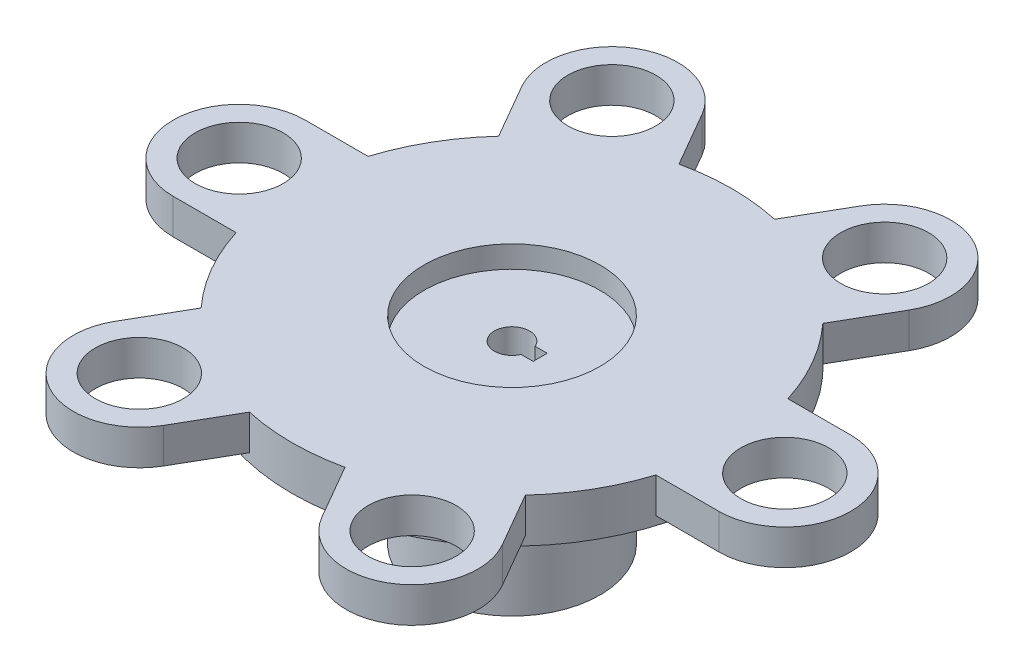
ISO-10303-21;
HEADER;
FILE_DESCRIPTION(('STEP AP214'),'2;1');
FILE_NAME('part.step','',(''),(''),'','','');
FILE_SCHEMA(('AUTOMOTIVE_DESIGN { 1 0 10303 214 1 1 1 1 }'));
ENDSEC;
DATA;
#1=APPLICATION_CONTEXT('core data for automotive mechanical design processes');
#2=APPLICATION_PROTOCOL_DEFINITION('international standard','automotive_design',2000,#1);
#3=PRODUCT_CONTEXT('',#1,'mechanical');
#4=PRODUCT('Part','Part','',(#3));
#5=PRODUCT_RELATED_PRODUCT_CATEGORY('part','',(#4));
#6=PRODUCT_DEFINITION_FORMATION('','',#4);
#7=PRODUCT_DEFINITION_CONTEXT('part definition',#1,'design');
#8=PRODUCT_DEFINITION('design','',#6,#7);
#9=PRODUCT_DEFINITION_SHAPE('','',#8);
#10=(LENGTH_UNIT() NAMED_UNIT(*) SI_UNIT(.MILLI.,.METRE.));
#11=(NAMED_UNIT(*) PLANE_ANGLE_UNIT() SI_UNIT($,.RADIAN.));
#12=(NAMED_UNIT(*) SI_UNIT($,.STERADIAN.) SOLID_ANGLE_UNIT());
#13=UNCERTAINTY_MEASURE_WITH_UNIT(LENGTH_MEASURE(1.E-05),#10,'distance_accuracy_value','');
#14=(GEOMETRIC_REPRESENTATION_CONTEXT(3) GLOBAL_UNCERTAINTY_ASSIGNED_CONTEXT((#13)) GLOBAL_UNIT_ASSIGNED_CONTEXT((#10,
#11,#12)) REPRESENTATION_CONTEXT('',''));
#15=CARTESIAN_POINT('',(0.,0.,0.));
#16=DIRECTION('',(0.,0.,1.));
#17=DIRECTION('',(1.,0.,0.));
#18=AXIS2_PLACEMENT_3D('',#15,#16,#17);
#19=CARTESIAN_POINT('',(0.,10.,0.));
#20=DIRECTION('',(0.,-1.,0.));
#21=DIRECTION('',(0.,0.,-1.));
#22=AXIS2_PLACEMENT_3D('',#19,#20,#21);
#23=CYLINDRICAL_SURFACE('',#22,10.);
#24=CARTESIAN_POINT('',(0.,-10.,0.));
#25=DIRECTION('',(0.,1.,0.));
#26=DIRECTION('',(0.,0.,1.));
#27=AXIS2_PLACEMENT_3D('',#24,#25,#26);
#28=CIRCLE('',#27,10.);
#29=CARTESIAN_POINT('',(0.,-10.,10.));
#30=VERTEX_POINT('',#29);
#31=EDGE_CURVE('E389',#30,#30,#28,.T.);
#32=ORIENTED_EDGE('',*,*,#31,.T.);
#33=EDGE_LOOP('',(#32));
#34=FACE_BOUND('',#33,.T.);
#35=CARTESIAN_POINT('',(0.,7.5,0.));
#36=DIRECTION('',(0.,1.,0.));
#37=DIRECTION('',(0.,0.,1.));
#38=AXIS2_PLACEMENT_3D('',#35,#36,#37);
#39=CIRCLE('',#38,10.);
#40=CARTESIAN_POINT('',(0.,7.5,10.));
#41=VERTEX_POINT('',#40);
#42=EDGE_CURVE('E401',#41,#41,#39,.T.);
#43=ORIENTED_EDGE('',*,*,#42,.F.);
#44=EDGE_LOOP('',(#43));
#45=FACE_BOUND('',#44,.T.);
#46=ADVANCED_FACE('F35',(#34,#45),#23,.T.);
#47=CARTESIAN_POINT('',(0.,10.,0.));
#48=DIRECTION('',(0.,1.,0.));
#49=DIRECTION('',(0.,0.,1.));
#50=AXIS2_PLACEMENT_3D('',#47,#48,#49);
#51=PLANE('',#50);
#52=DIRECTION('',(1.,0.,0.));
#53=VECTOR('',#52,1.);
#54=CARTESIAN_POINT('',(1.59788848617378,10.,0.8));
#55=LINE('',#54,#53);
#56=CARTESIAN_POINT('',(1.83303027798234,10.,0.8));
#57=VERTEX_POINT('',#56);
#58=CARTESIAN_POINT('',(3.2,10.,0.8));
#59=VERTEX_POINT('',#58);
#60=EDGE_CURVE('E372',#57,#59,#55,.T.);
#61=ORIENTED_EDGE('',*,*,#60,.F.);
#62=CARTESIAN_POINT('',(0.,10.,0.));
#63=DIRECTION('',(0.,1.,0.));
#64=DIRECTION('',(0.,0.,1.));
#65=AXIS2_PLACEMENT_3D('',#62,#63,#64);
#66=CIRCLE('',#65,2.);
#67=CARTESIAN_POINT('',(1.83303027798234,10.,-0.8));
#68=VERTEX_POINT('',#67);
#69=EDGE_CURVE('E386',#68,#57,#66,.T.);
#70=ORIENTED_EDGE('',*,*,#69,.F.);
#71=DIRECTION('',(-1.,0.,0.));
#72=VECTOR('',#71,1.);
#73=CARTESIAN_POINT('',(1.59788848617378,10.,-0.8));
#74=LINE('',#73,#72);
#75=CARTESIAN_POINT('',(3.2,10.,-0.8));
#76=VERTEX_POINT('',#75);
#77=EDGE_CURVE('E370',#76,#68,#74,.T.);
#78=ORIENTED_EDGE('',*,*,#77,.F.);
#79=DIRECTION('',(0.,0.,-1.));
#80=VECTOR('',#79,1.);
#81=CARTESIAN_POINT('',(3.2,10.,-0.8));
#82=LINE('',#81,#80);
#83=EDGE_CURVE('E367',#59,#76,#82,.T.);
#84=ORIENTED_EDGE('',*,*,#83,.F.);
#85=EDGE_LOOP('',(#61,#70,#78,#84));
#86=FACE_BOUND('',#85,.T.);
#87=CARTESIAN_POINT('',(0.,10.,0.));
#88=DIRECTION('',(0.,1.,0.));
#89=DIRECTION('',(0.,0.,1.));
#90=AXIS2_PLACEMENT_3D('',#87,#88,#89);
#91=CIRCLE('',#90,10.);
#92=CARTESIAN_POINT('',(0.,10.,10.));
#93=VERTEX_POINT('',#92);
#94=EDGE_CURVE('E360',#93,#93,#91,.F.);
#95=ORIENTED_EDGE('',*,*,#94,.F.);
#96=EDGE_LOOP('',(#95));
#97=FACE_BOUND('',#96,.T.);
#98=ADVANCED_FACE('F481',(#86,#97),#51,.T.);
#99=CARTESIAN_POINT('',(0.,-10.,0.));
#100=DIRECTION('',(0.,1.,0.));
#101=DIRECTION('',(0.,0.,1.));
#102=AXIS2_PLACEMENT_3D('',#99,#100,#101);
#103=PLANE('',#102);
#104=ORIENTED_EDGE('',*,*,#31,.F.);
#105=EDGE_LOOP('',(#104));
#106=FACE_BOUND('',#105,.T.);
#107=CARTESIAN_POINT('',(0.,-10.,0.));
#108=DIRECTION('',(0.,1.,0.));
#109=DIRECTION('',(0.,0.,1.));
#110=AXIS2_PLACEMENT_3D('',#107,#108,#109);
#111=CIRCLE('',#110,2.);
#112=CARTESIAN_POINT('',(1.83303027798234,-10.,-0.8));
#113=VERTEX_POINT('',#112);
#114=CARTESIAN_POINT('',(1.83303027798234,-10.,0.8));
#115=VERTEX_POINT('',#114);
#116=EDGE_CURVE('E385',#113,#115,#111,.T.);
#117=ORIENTED_EDGE('',*,*,#116,.T.);
#118=DIRECTION('',(1.,0.,0.));
#119=VECTOR('',#118,1.);
#120=CARTESIAN_POINT('',(0.,-10.,0.8));
#121=LINE('',#120,#119);
#122=CARTESIAN_POINT('',(3.2,-10.,0.8));
#123=VERTEX_POINT('',#122);
#124=EDGE_CURVE('E382',#115,#123,#121,.T.);
#125=ORIENTED_EDGE('',*,*,#124,.T.);
#126=DIRECTION('',(0.,0.,-1.));
#127=VECTOR('',#126,1.);
#128=CARTESIAN_POINT('',(3.2,-10.,0.));
#129=LINE('',#128,#127);
#130=CARTESIAN_POINT('',(3.2,-10.,-0.8));
#131=VERTEX_POINT('',#130);
#132=EDGE_CURVE('E398',#123,#131,#129,.T.);
#133=ORIENTED_EDGE('',*,*,#132,.T.);
#134=DIRECTION('',(-1.,0.,0.));
#135=VECTOR('',#134,1.);
#136=CARTESIAN_POINT('',(0.,-10.,-0.8));
#137=LINE('',#136,#135);
#138=EDGE_CURVE('E378',#131,#113,#137,.T.);
#139=ORIENTED_EDGE('',*,*,#138,.T.);
#140=EDGE_LOOP('',(#117,#125,#133,#139));
#141=FACE_BOUND('',#140,.T.);
#142=ADVANCED_FACE('F488',(#106,#141),#103,.F.);
#143=CARTESIAN_POINT('',(0.,10.,0.));
#144=DIRECTION('',(0.,-1.,0.));
#145=DIRECTION('',(0.,0.,-1.));
#146=AXIS2_PLACEMENT_3D('',#143,#144,#145);
#147=CYLINDRICAL_SURFACE('',#146,2.);
#148=DIRECTION('',(0.,-1.,0.));
#149=VECTOR('',#148,1.);
#150=CARTESIAN_POINT('',(1.83303027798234,10.,0.8));
#151=LINE('',#150,#149);
#152=EDGE_CURVE('E396',#115,#57,#151,.F.);
#153=ORIENTED_EDGE('',*,*,#152,.F.);
#154=ORIENTED_EDGE('',*,*,#116,.F.);
#155=DIRECTION('',(0.,-1.,0.));
#156=VECTOR('',#155,1.);
#157=CARTESIAN_POINT('',(1.83303027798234,10.,-0.8));
#158=LINE('',#157,#156);
#159=EDGE_CURVE('E394',#68,#113,#158,.T.);
#160=ORIENTED_EDGE('',*,*,#159,.F.);
#161=ORIENTED_EDGE('',*,*,#69,.T.);
#162=EDGE_LOOP('',(#153,#154,#160,#161));
#163=FACE_BOUND('',#162,.T.);
#164=ADVANCED_FACE('F524',(#163),#147,.F.);
#165=CARTESIAN_POINT('',(3.2,-20.,-0.8));
#166=DIRECTION('',(1.,0.,0.));
#167=DIRECTION('',(0.,0.,-1.));
#168=AXIS2_PLACEMENT_3D('',#165,#166,#167);
#169=PLANE('',#168);
#170=DIRECTION('',(0.,1.,0.));
#171=VECTOR('',#170,1.);
#172=CARTESIAN_POINT('',(3.2,-20.,0.8));
#173=LINE('',#172,#171);
#174=EDGE_CURVE('E376',#123,#59,#173,.T.);
#175=ORIENTED_EDGE('',*,*,#174,.T.);
#176=ORIENTED_EDGE('',*,*,#83,.T.);
#177=DIRECTION('',(0.,1.,0.));
#178=VECTOR('',#177,1.);
#179=CARTESIAN_POINT('',(3.2,-20.,-0.8));
#180=LINE('',#179,#178);
#181=EDGE_CURVE('E375',#131,#76,#180,.T.);
#182=ORIENTED_EDGE('',*,*,#181,.F.);
#183=ORIENTED_EDGE('',*,*,#132,.F.);
#184=EDGE_LOOP('',(#175,#176,#182,#183));
#185=FACE_BOUND('',#184,.T.);
#186=ADVANCED_FACE('F518',(#185),#169,.F.);
#187=CARTESIAN_POINT('',(1.59788848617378,-20.,0.8));
#188=DIRECTION('',(0.,0.,1.));
#189=DIRECTION('',(1.,0.,0.));
#190=AXIS2_PLACEMENT_3D('',#187,#188,#189);
#191=PLANE('',#190);
#192=ORIENTED_EDGE('',*,*,#152,.T.);
#193=ORIENTED_EDGE('',*,*,#60,.T.);
#194=ORIENTED_EDGE('',*,*,#174,.F.);
#195=ORIENTED_EDGE('',*,*,#124,.F.);
#196=EDGE_LOOP('',(#192,#193,#194,#195));
#197=FACE_BOUND('',#196,.T.);
#198=ADVANCED_FACE('F515',(#197),#191,.F.);
#199=CARTESIAN_POINT('',(1.59788848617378,-20.,-0.8));
#200=DIRECTION('',(0.,0.,-1.));
#201=DIRECTION('',(-1.,0.,0.));
#202=AXIS2_PLACEMENT_3D('',#199,#200,#201);
#203=PLANE('',#202);
#204=ORIENTED_EDGE('',*,*,#181,.T.);
#205=ORIENTED_EDGE('',*,*,#77,.T.);
#206=ORIENTED_EDGE('',*,*,#159,.T.);
#207=ORIENTED_EDGE('',*,*,#138,.F.);
#208=EDGE_LOOP('',(#204,#205,#206,#207));
#209=FACE_BOUND('',#208,.T.);
#210=ADVANCED_FACE('F509',(#209),#203,.F.);
#211=CARTESIAN_POINT('',(0.,12.5,0.));
#212=DIRECTION('',(0.,1.,0.));
#213=DIRECTION('',(0.,0.,1.));
#214=AXIS2_PLACEMENT_3D('',#211,#212,#213);
#215=PLANE('',#214);
#216=CARTESIAN_POINT('',(31.,12.5,2.46330733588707E-13));
#217=DIRECTION('',(0.,1.,0.));
#218=DIRECTION('',(0.,0.,1.));
#219=AXIS2_PLACEMENT_3D('',#216,#217,#218);
#220=CIRCLE('',#219,5.);
#221=CARTESIAN_POINT('',(31.,12.5,5.00000000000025));
#222=VERTEX_POINT('',#221);
#223=EDGE_CURVE('E735',#222,#222,#220,.T.);
#224=ORIENTED_EDGE('',*,*,#223,.F.);
#225=EDGE_LOOP('',(#224));
#226=FACE_BOUND('',#225,.T.);
#227=CARTESIAN_POINT('',(15.5000000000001,12.5,-26.8467875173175));
#228=DIRECTION('',(0.,1.,0.));
#229=DIRECTION('',(0.,0.,1.));
#230=AXIS2_PLACEMENT_3D('',#227,#228,#229);
#231=CIRCLE('',#230,5.);
#232=CARTESIAN_POINT('',(15.5000000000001,12.5,-21.8467875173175));
#233=VERTEX_POINT('',#232);
#234=EDGE_CURVE('E734',#233,#233,#231,.T.);
#235=ORIENTED_EDGE('',*,*,#234,.F.);
#236=EDGE_LOOP('',(#235));
#237=FACE_BOUND('',#236,.T.);
#238=CARTESIAN_POINT('',(-15.4999999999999,12.5,-26.8467875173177));
#239=DIRECTION('',(0.,1.,0.));
#240=DIRECTION('',(0.,0.,1.));
#241=AXIS2_PLACEMENT_3D('',#238,#239,#240);
#242=CIRCLE('',#241,5.);
#243=CARTESIAN_POINT('',(-15.4999999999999,12.5,-21.8467875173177));
#244=VERTEX_POINT('',#243);
#245=EDGE_CURVE('E729',#244,#244,#242,.T.);
#246=ORIENTED_EDGE('',*,*,#245,.F.);
#247=EDGE_LOOP('',(#246));
#248=FACE_BOUND('',#247,.T.);
#249=CARTESIAN_POINT('',(-31.,12.5,0.));
#250=DIRECTION('',(0.,1.,0.));
#251=DIRECTION('',(0.,0.,1.));
#252=AXIS2_PLACEMENT_3D('',#249,#250,#251);
#253=CIRCLE('',#252,5.);
#254=CARTESIAN_POINT('',(-31.,12.5,4.99999999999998));
#255=VERTEX_POINT('',#254);
#256=EDGE_CURVE('E725',#255,#255,#253,.T.);
#257=ORIENTED_EDGE('',*,*,#256,.F.);
#258=EDGE_LOOP('',(#257));
#259=FACE_BOUND('',#258,.T.);
#260=CARTESIAN_POINT('',(-15.5,12.5,26.8467875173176));
#261=DIRECTION('',(0.,1.,0.));
#262=DIRECTION('',(0.,0.,1.));
#263=AXIS2_PLACEMENT_3D('',#260,#261,#262);
#264=CIRCLE('',#263,5.00000000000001);
#265=CARTESIAN_POINT('',(-15.5,12.5,31.8467875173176));
#266=VERTEX_POINT('',#265);
#267=EDGE_CURVE('E665',#266,#266,#264,.T.);
#268=ORIENTED_EDGE('',*,*,#267,.F.);
#269=EDGE_LOOP('',(#268));
#270=FACE_BOUND('',#269,.T.);
#271=CARTESIAN_POINT('',(15.4999999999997,12.5,26.8467875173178));
#272=DIRECTION('',(0.,1.,0.));
#273=DIRECTION('',(0.,0.,1.));
#274=AXIS2_PLACEMENT_3D('',#271,#272,#273);
#275=CIRCLE('',#274,5.0000000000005);
#276=CARTESIAN_POINT('',(15.4999999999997,12.5,31.8467875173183));
#277=VERTEX_POINT('',#276);
#278=EDGE_CURVE('E247',#277,#277,#275,.T.);
#279=ORIENTED_EDGE('',*,*,#278,.F.);
#280=EDGE_LOOP('',(#279));
#281=FACE_BOUND('',#280,.T.);
#282=CARTESIAN_POINT('',(0.,12.5,0.));
#283=DIRECTION('',(0.,1.,0.));
#284=DIRECTION('',(0.,0.,1.));
#285=AXIS2_PLACEMENT_3D('',#282,#283,#284);
#286=CIRCLE('',#285,24.999999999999);
#287=CARTESIAN_POINT('',(23.8484800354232,12.5,-7.49999999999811));
#288=VERTEX_POINT('',#287);
#289=CARTESIAN_POINT('',(18.4194305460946,12.5,-16.903389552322));
#290=VERTEX_POINT('',#289);
#291=EDGE_CURVE('E357',#288,#290,#286,.T.);
#292=ORIENTED_EDGE('',*,*,#291,.T.);
#293=DIRECTION('',(0.499999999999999,0.,-0.866025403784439));
#294=VECTOR('',#293,1.);
#295=CARTESIAN_POINT('',(21.9951905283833,12.5,-23.0967875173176));
#296=LINE('',#295,#294);
#297=CARTESIAN_POINT('',(21.9951905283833,12.5,-23.0967875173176));
#298=VERTEX_POINT('',#297);
#299=EDGE_CURVE('E243',#290,#298,#296,.T.);
#300=ORIENTED_EDGE('',*,*,#299,.T.);
#301=CARTESIAN_POINT('',(15.5000000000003,12.5,-26.8467875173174));
#302=DIRECTION('',(0.,1.,0.));
#303=DIRECTION('',(0.,0.,1.));
#304=AXIS2_PLACEMENT_3D('',#301,#302,#303);
#305=CIRCLE('',#304,7.49999999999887);
#306=CARTESIAN_POINT('',(9.00480947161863,12.5,-30.5967875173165));
#307=VERTEX_POINT('',#306);
#308=EDGE_CURVE('E251',#298,#307,#305,.T.);
#309=ORIENTED_EDGE('',*,*,#308,.T.);
#310=DIRECTION('',(-0.499999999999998,0.,0.86602540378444));
#311=VECTOR('',#310,1.);
#312=CARTESIAN_POINT('',(9.00480947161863,12.5,-30.5967875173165));
#313=LINE('',#312,#311);
#314=CARTESIAN_POINT('',(5.4290494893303,12.5,-24.4033895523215));
#315=VERTEX_POINT('',#314);
#316=EDGE_CURVE('E51',#307,#315,#313,.T.);
#317=ORIENTED_EDGE('',*,*,#316,.T.);
#318=CARTESIAN_POINT('',(-5.42904948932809,12.5,-24.403389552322));
#319=VERTEX_POINT('',#318);
#320=EDGE_CURVE('E361',#315,#319,#286,.T.);
#321=ORIENTED_EDGE('',*,*,#320,.T.);
#322=DIRECTION('',(-0.500000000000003,0.,-0.866025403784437));
#323=VECTOR('',#322,1.);
#324=CARTESIAN_POINT('',(-9.00480947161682,12.5,-30.5967875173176));
#325=LINE('',#324,#323);
#326=CARTESIAN_POINT('',(-9.00480947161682,12.5,-30.5967875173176));
#327=VERTEX_POINT('',#326);
#328=EDGE_CURVE('E260',#319,#327,#325,.T.);
#329=ORIENTED_EDGE('',*,*,#328,.T.);
#330=CARTESIAN_POINT('',(-15.4999999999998,12.5,-26.8467875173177));
#331=DIRECTION('',(0.,1.,0.));
#332=DIRECTION('',(0.,0.,1.));
#333=AXIS2_PLACEMENT_3D('',#330,#331,#332);
#334=CIRCLE('',#333,7.49999999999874);
#335=CARTESIAN_POINT('',(-21.995190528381,12.5,-23.0967875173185));
#336=VERTEX_POINT('',#335);
#337=EDGE_CURVE('E254',#327,#336,#334,.T.);
#338=ORIENTED_EDGE('',*,*,#337,.T.);
#339=DIRECTION('',(0.500000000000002,0.,0.866025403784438));
#340=VECTOR('',#339,1.);
#341=CARTESIAN_POINT('',(-21.995190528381,12.5,-23.0967875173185));
#342=LINE('',#341,#340);
#343=CARTESIAN_POINT('',(-18.4194305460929,12.5,-16.9033895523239));
#344=VERTEX_POINT('',#343);
#345=EDGE_CURVE('E58',#336,#344,#342,.T.);
#346=ORIENTED_EDGE('',*,*,#345,.T.);
#347=CARTESIAN_POINT('',(-23.8484800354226,12.5,-7.49999999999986));
#348=VERTEX_POINT('',#347);
#349=EDGE_CURVE('E684',#344,#348,#286,.T.);
#350=ORIENTED_EDGE('',*,*,#349,.T.);
#351=DIRECTION('',(-1.,0.,0.));
#352=VECTOR('',#351,1.);
#353=CARTESIAN_POINT('',(-31.0000000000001,12.5,-7.49999999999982));
#354=LINE('',#353,#352);
#355=CARTESIAN_POINT('',(-31.0000000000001,12.5,-7.49999999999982));
#356=VERTEX_POINT('',#355);
#357=EDGE_CURVE('E278',#348,#356,#354,.T.);
#358=ORIENTED_EDGE('',*,*,#357,.T.);
#359=CARTESIAN_POINT('',(-31.,12.5,-2.16471843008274E-13));
#360=DIRECTION('',(0.,1.,0.));
#361=DIRECTION('',(0.,0.,1.));
#362=AXIS2_PLACEMENT_3D('',#359,#360,#361);
#363=CIRCLE('',#362,7.49999999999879);
#364=CARTESIAN_POINT('',(-30.9999999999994,12.5,7.49999999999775));
#365=VERTEX_POINT('',#364);
#366=EDGE_CURVE('E272',#356,#365,#363,.T.);
#367=ORIENTED_EDGE('',*,*,#366,.T.);
#368=DIRECTION('',(1.,0.,0.));
#369=VECTOR('',#368,1.);
#370=CARTESIAN_POINT('',(-30.9999999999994,12.5,7.49999999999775));
#371=LINE('',#370,#369);
#372=CARTESIAN_POINT('',(-23.8484800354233,12.5,7.49999999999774));
#373=VERTEX_POINT('',#372);
#374=EDGE_CURVE('E286',#365,#373,#371,.T.);
#375=ORIENTED_EDGE('',*,*,#374,.T.);
#376=CARTESIAN_POINT('',(-18.4194305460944,12.5,16.9033895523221));
#377=VERTEX_POINT('',#376);
#378=EDGE_CURVE('E681',#373,#377,#286,.T.);
#379=ORIENTED_EDGE('',*,*,#378,.T.);
#380=DIRECTION('',(-0.499999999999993,0.,0.866025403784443));
#381=VECTOR('',#380,1.);
#382=CARTESIAN_POINT('',(-21.9951905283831,12.5,23.0967875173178));
#383=LINE('',#382,#381);
#384=CARTESIAN_POINT('',(-21.9951905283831,12.5,23.0967875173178));
#385=VERTEX_POINT('',#384);
#386=EDGE_CURVE('E298',#377,#385,#383,.T.);
#387=ORIENTED_EDGE('',*,*,#386,.T.);
#388=CARTESIAN_POINT('',(-15.5000000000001,12.5,26.8467875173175));
#389=DIRECTION('',(0.,1.,0.));
#390=DIRECTION('',(0.,0.,1.));
#391=AXIS2_PLACEMENT_3D('',#388,#389,#390);
#392=CIRCLE('',#391,7.49999999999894);
#393=CARTESIAN_POINT('',(-9.00480947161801,12.5,30.5967875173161));
#394=VERTEX_POINT('',#393);
#395=EDGE_CURVE('E292',#385,#394,#392,.T.);
#396=ORIENTED_EDGE('',*,*,#395,.T.);
#397=DIRECTION('',(0.499999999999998,0.,-0.866025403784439));
#398=VECTOR('',#397,1.);
#399=CARTESIAN_POINT('',(-9.00480947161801,12.5,30.5967875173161));
#400=LINE('',#399,#398);
#401=CARTESIAN_POINT('',(-5.42904948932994,12.5,24.4033895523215));
#402=VERTEX_POINT('',#401);
#403=EDGE_CURVE('E306',#394,#402,#400,.T.);
#404=ORIENTED_EDGE('',*,*,#403,.T.);
#405=CARTESIAN_POINT('',(5.42904948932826,12.5,24.4033895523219));
#406=VERTEX_POINT('',#405);
#407=EDGE_CURVE('E677',#402,#406,#286,.T.);
#408=ORIENTED_EDGE('',*,*,#407,.T.);
#409=DIRECTION('',(0.500000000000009,0.,0.866025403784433));
#410=VECTOR('',#409,1.);
#411=CARTESIAN_POINT('',(9.00480947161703,12.5,30.5967875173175));
#412=LINE('',#411,#410);
#413=CARTESIAN_POINT('',(9.00480947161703,12.5,30.5967875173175));
#414=VERTEX_POINT('',#413);
#415=EDGE_CURVE('E318',#406,#414,#412,.T.);
#416=ORIENTED_EDGE('',*,*,#415,.T.);
#417=CARTESIAN_POINT('',(15.5,12.5,26.8467875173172));
#418=DIRECTION('',(0.,1.,0.));
#419=DIRECTION('',(0.,0.,1.));
#420=AXIS2_PLACEMENT_3D('',#417,#418,#419);
#421=CIRCLE('',#420,7.499999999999);
#422=CARTESIAN_POINT('',(21.9951905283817,12.5,23.0967875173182));
#423=VERTEX_POINT('',#422);
#424=EDGE_CURVE('E312',#414,#423,#421,.T.);
#425=ORIENTED_EDGE('',*,*,#424,.T.);
#426=DIRECTION('',(-0.500000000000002,0.,-0.866025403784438));
#427=VECTOR('',#426,1.);
#428=CARTESIAN_POINT('',(21.9951905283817,12.5,23.0967875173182));
#429=LINE('',#428,#427);
#430=CARTESIAN_POINT('',(18.4194305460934,12.5,16.9033895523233));
#431=VERTEX_POINT('',#430);
#432=EDGE_CURVE('E326',#423,#431,#429,.T.);
#433=ORIENTED_EDGE('',*,*,#432,.T.);
#434=CARTESIAN_POINT('',(23.8484800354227,12.5,7.4999999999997));
#435=VERTEX_POINT('',#434);
#436=EDGE_CURVE('E362',#431,#435,#286,.T.);
#437=ORIENTED_EDGE('',*,*,#436,.T.);
#438=DIRECTION('',(1.,0.,0.));
#439=VECTOR('',#438,1.);
#440=CARTESIAN_POINT('',(31.,12.5,7.49999999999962));
#441=LINE('',#440,#439);
#442=CARTESIAN_POINT('',(31.,12.5,7.49999999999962));
#443=VERTEX_POINT('',#442);
#444=EDGE_CURVE('E338',#435,#443,#441,.T.);
#445=ORIENTED_EDGE('',*,*,#444,.T.);
#446=CARTESIAN_POINT('',(31.,12.5,0.));
#447=DIRECTION('',(0.,1.,0.));
#448=DIRECTION('',(0.,0.,1.));
#449=AXIS2_PLACEMENT_3D('',#446,#447,#448);
#450=CIRCLE('',#449,7.49999999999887);
#451=CARTESIAN_POINT('',(31.,12.5,-7.49999999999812));
#452=VERTEX_POINT('',#451);
#453=EDGE_CURVE('E332',#443,#452,#450,.T.);
#454=ORIENTED_EDGE('',*,*,#453,.T.);
#455=DIRECTION('',(-1.,0.,0.));
#456=VECTOR('',#455,1.);
#457=CARTESIAN_POINT('',(31.,12.5,-7.49999999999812));
#458=LINE('',#457,#456);
#459=EDGE_CURVE('E346',#452,#288,#458,.T.);
#460=ORIENTED_EDGE('',*,*,#459,.T.);
#461=EDGE_LOOP('',(#292,#300,#309,#317,#321,#329,#338,#346,#350,#358,#367,#375,#379,#387,#396,
#404,#408,#416,#425,#433,#437,#445,#454,#460));
#462=FACE_BOUND('',#461,.T.);
#463=CARTESIAN_POINT('',(0.,12.5,0.));
#464=DIRECTION('',(0.,1.,0.));
#465=DIRECTION('',(0.,0.,1.));
#466=AXIS2_PLACEMENT_3D('',#463,#464,#465);
#467=CIRCLE('',#466,10.);
#468=CARTESIAN_POINT('',(0.,12.5,10.));
#469=VERTEX_POINT('',#468);
#470=EDGE_CURVE('E352',#469,#469,#467,.T.);
#471=ORIENTED_EDGE('',*,*,#470,.F.);
#472=EDGE_LOOP('',(#471));
#473=FACE_BOUND('',#472,.T.);
#474=ADVANCED_FACE('F498',(#226,#237,#248,#259,#270,#281,#462,#473),#215,.T.);
#475=CARTESIAN_POINT('',(0.,7.5,0.));
#476=DIRECTION('',(0.,1.,0.));
#477=DIRECTION('',(0.,0.,1.));
#478=AXIS2_PLACEMENT_3D('',#475,#476,#477);
#479=PLANE('',#478);
#480=CARTESIAN_POINT('',(0.,7.5,0.));
#481=DIRECTION('',(0.,1.,0.));
#482=DIRECTION('',(0.,0.,1.));
#483=AXIS2_PLACEMENT_3D('',#480,#481,#482);
#484=CIRCLE('',#483,24.999999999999);
#485=CARTESIAN_POINT('',(0.,7.5,24.999999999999));
#486=VERTEX_POINT('',#485);
#487=EDGE_CURVE('E356',#486,#486,#484,.T.);
#488=ORIENTED_EDGE('',*,*,#487,.F.);
#489=EDGE_LOOP('',(#488));
#490=FACE_BOUND('',#489,.T.);
#491=ORIENTED_EDGE('',*,*,#42,.T.);
#492=EDGE_LOOP('',(#491));
#493=FACE_BOUND('',#492,.T.);
#494=ADVANCED_FACE('F495',(#490,#493),#479,.F.);
#495=CARTESIAN_POINT('',(0.,12.5,0.));
#496=DIRECTION('',(0.,-1.,0.));
#497=DIRECTION('',(0.,0.,-1.));
#498=AXIS2_PLACEMENT_3D('',#495,#496,#497);
#499=CYLINDRICAL_SURFACE('',#498,24.999999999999);
#500=CARTESIAN_POINT('',(0.,8.5,0.));
#501=DIRECTION('',(0.,1.,0.));
#502=DIRECTION('',(0.,0.,1.));
#503=AXIS2_PLACEMENT_3D('',#500,#501,#502);
#504=CIRCLE('',#503,24.999999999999);
#505=CARTESIAN_POINT('',(18.4194305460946,8.5,-16.903389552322));
#506=VERTEX_POINT('',#505);
#507=CARTESIAN_POINT('',(5.4290494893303,8.5,-24.4033895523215));
#508=VERTEX_POINT('',#507);
#509=EDGE_CURVE('E238',#506,#508,#504,.T.);
#510=ORIENTED_EDGE('',*,*,#509,.F.);
#511=DIRECTION('',(0.,-1.,0.));
#512=VECTOR('',#511,1.);
#513=CARTESIAN_POINT('',(18.4194305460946,12.5,-16.903389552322));
#514=LINE('',#513,#512);
#515=EDGE_CURVE('E11',#506,#290,#514,.F.);
#516=ORIENTED_EDGE('',*,*,#515,.T.);
#517=ORIENTED_EDGE('',*,*,#291,.F.);
#518=DIRECTION('',(0.,-1.,0.));
#519=VECTOR('',#518,1.);
#520=CARTESIAN_POINT('',(23.8484800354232,12.5,-7.49999999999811));
#521=LINE('',#520,#519);
#522=CARTESIAN_POINT('',(23.8484800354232,8.5,-7.49999999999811));
#523=VERTEX_POINT('',#522);
#524=EDGE_CURVE('E406',#288,#523,#521,.T.);
#525=ORIENTED_EDGE('',*,*,#524,.T.);
#526=CARTESIAN_POINT('',(0.,8.5,0.));
#527=DIRECTION('',(0.,1.,0.));
#528=DIRECTION('',(0.,0.,1.));
#529=AXIS2_PLACEMENT_3D('',#526,#527,#528);
#530=CIRCLE('',#529,24.999999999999);
#531=CARTESIAN_POINT('',(23.8484800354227,8.5,7.4999999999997));
#532=VERTEX_POINT('',#531);
#533=EDGE_CURVE('E404',#532,#523,#530,.T.);
#534=ORIENTED_EDGE('',*,*,#533,.F.);
#535=DIRECTION('',(0.,-1.,0.));
#536=VECTOR('',#535,1.);
#537=CARTESIAN_POINT('',(23.8484800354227,12.5,7.4999999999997));
#538=LINE('',#537,#536);
#539=EDGE_CURVE('E409',#532,#435,#538,.F.);
#540=ORIENTED_EDGE('',*,*,#539,.T.);
#541=ORIENTED_EDGE('',*,*,#436,.F.);
#542=DIRECTION('',(0.,-1.,0.));
#543=VECTOR('',#542,1.);
#544=CARTESIAN_POINT('',(18.4194305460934,12.5,16.9033895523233));
#545=LINE('',#544,#543);
#546=CARTESIAN_POINT('',(18.4194305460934,8.5,16.9033895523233));
#547=VERTEX_POINT('',#546);
#548=EDGE_CURVE('E414',#431,#547,#545,.T.);
#549=ORIENTED_EDGE('',*,*,#548,.T.);
#550=CARTESIAN_POINT('',(0.,8.5,0.));
#551=DIRECTION('',(0.,1.,0.));
#552=DIRECTION('',(0.,0.,1.));
#553=AXIS2_PLACEMENT_3D('',#550,#551,#552);
#554=CIRCLE('',#553,24.999999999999);
#555=CARTESIAN_POINT('',(5.42904948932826,8.5,24.4033895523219));
#556=VERTEX_POINT('',#555);
#557=EDGE_CURVE('E412',#556,#547,#554,.T.);
#558=ORIENTED_EDGE('',*,*,#557,.F.);
#559=DIRECTION('',(0.,-1.,0.));
#560=VECTOR('',#559,1.);
#561=CARTESIAN_POINT('',(5.42904948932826,12.5,24.4033895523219));
#562=LINE('',#561,#560);
#563=EDGE_CURVE('E417',#556,#406,#562,.F.);
#564=ORIENTED_EDGE('',*,*,#563,.T.);
#565=ORIENTED_EDGE('',*,*,#407,.F.);
#566=DIRECTION('',(0.,-1.,0.));
#567=VECTOR('',#566,1.);
#568=CARTESIAN_POINT('',(-5.42904948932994,12.5,24.4033895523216));
#569=LINE('',#568,#567);
#570=CARTESIAN_POINT('',(-5.42904948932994,8.5,24.4033895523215));
#571=VERTEX_POINT('',#570);
#572=EDGE_CURVE('E422',#402,#571,#569,.T.);
#573=ORIENTED_EDGE('',*,*,#572,.T.);
#574=CARTESIAN_POINT('',(0.,8.5,0.));
#575=DIRECTION('',(0.,1.,0.));
#576=DIRECTION('',(0.,0.,1.));
#577=AXIS2_PLACEMENT_3D('',#574,#575,#576);
#578=CIRCLE('',#577,24.999999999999);
#579=CARTESIAN_POINT('',(-18.4194305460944,8.5,16.9033895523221));
#580=VERTEX_POINT('',#579);
#581=EDGE_CURVE('E420',#580,#571,#578,.T.);
#582=ORIENTED_EDGE('',*,*,#581,.F.);
#583=DIRECTION('',(0.,-1.,0.));
#584=VECTOR('',#583,1.);
#585=CARTESIAN_POINT('',(-18.4194305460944,12.5,16.9033895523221));
#586=LINE('',#585,#584);
#587=EDGE_CURVE('E425',#580,#377,#586,.F.);
#588=ORIENTED_EDGE('',*,*,#587,.T.);
#589=ORIENTED_EDGE('',*,*,#378,.F.);
#590=DIRECTION('',(0.,-1.,0.));
#591=VECTOR('',#590,1.);
#592=CARTESIAN_POINT('',(-23.8484800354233,12.5,7.49999999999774));
#593=LINE('',#592,#591);
#594=CARTESIAN_POINT('',(-23.8484800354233,8.5,7.49999999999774));
#595=VERTEX_POINT('',#594);
#596=EDGE_CURVE('E430',#373,#595,#593,.T.);
#597=ORIENTED_EDGE('',*,*,#596,.T.);
#598=CARTESIAN_POINT('',(0.,8.5,0.));
#599=DIRECTION('',(0.,1.,0.));
#600=DIRECTION('',(0.,0.,1.));
#601=AXIS2_PLACEMENT_3D('',#598,#599,#600);
#602=CIRCLE('',#601,24.999999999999);
#603=CARTESIAN_POINT('',(-23.8484800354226,8.5,-7.49999999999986));
#604=VERTEX_POINT('',#603);
#605=EDGE_CURVE('E428',#604,#595,#602,.T.);
#606=ORIENTED_EDGE('',*,*,#605,.F.);
#607=DIRECTION('',(0.,-1.,0.));
#608=VECTOR('',#607,1.);
#609=CARTESIAN_POINT('',(-23.8484800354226,12.5,-7.49999999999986));
#610=LINE('',#609,#608);
#611=EDGE_CURVE('E433',#604,#348,#610,.F.);
#612=ORIENTED_EDGE('',*,*,#611,.T.);
#613=ORIENTED_EDGE('',*,*,#349,.F.);
#614=DIRECTION('',(0.,-1.,0.));
#615=VECTOR('',#614,1.);
#616=CARTESIAN_POINT('',(-18.4194305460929,12.5,-16.9033895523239));
#617=LINE('',#616,#615);
#618=CARTESIAN_POINT('',(-18.4194305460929,8.5,-16.9033895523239));
#619=VERTEX_POINT('',#618);
#620=EDGE_CURVE('E438',#344,#619,#617,.T.);
#621=ORIENTED_EDGE('',*,*,#620,.T.);
#622=CARTESIAN_POINT('',(0.,8.5,0.));
#623=DIRECTION('',(0.,1.,0.));
#624=DIRECTION('',(0.,0.,1.));
#625=AXIS2_PLACEMENT_3D('',#622,#623,#624);
#626=CIRCLE('',#625,24.999999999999);
#627=CARTESIAN_POINT('',(-5.42904948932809,8.5,-24.403389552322));
#628=VERTEX_POINT('',#627);
#629=EDGE_CURVE('E436',#628,#619,#626,.T.);
#630=ORIENTED_EDGE('',*,*,#629,.F.);
#631=DIRECTION('',(0.,-1.,0.));
#632=VECTOR('',#631,1.);
#633=CARTESIAN_POINT('',(-5.42904948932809,12.5,-24.403389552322));
#634=LINE('',#633,#632);
#635=EDGE_CURVE('E441',#628,#319,#634,.F.);
#636=ORIENTED_EDGE('',*,*,#635,.T.);
#637=ORIENTED_EDGE('',*,*,#320,.F.);
#638=DIRECTION('',(0.,-1.,0.));
#639=VECTOR('',#638,1.);
#640=CARTESIAN_POINT('',(5.4290494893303,12.5,-24.4033895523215));
#641=LINE('',#640,#639);
#642=EDGE_CURVE('E43',#315,#508,#641,.T.);
#643=ORIENTED_EDGE('',*,*,#642,.T.);
#644=EDGE_LOOP('',(#510,#516,#517,#525,#534,#540,#541,#549,#558,#564,#565,#573,#582,#588,#589,
#597,#606,#612,#613,#621,#630,#636,#637,#643));
#645=FACE_BOUND('',#644,.T.);
#646=ORIENTED_EDGE('',*,*,#487,.T.);
#647=EDGE_LOOP('',(#646));
#648=FACE_BOUND('',#647,.T.);
#649=ADVANCED_FACE('F497',(#645,#648),#499,.T.);
#650=CARTESIAN_POINT('',(0.,12.5,0.));
#651=DIRECTION('',(0.,-1.,0.));
#652=DIRECTION('',(0.,0.,-1.));
#653=AXIS2_PLACEMENT_3D('',#650,#651,#652);
#654=CYLINDRICAL_SURFACE('',#653,10.);
#655=ORIENTED_EDGE('',*,*,#94,.T.);
#656=EDGE_LOOP('',(#655));
#657=FACE_BOUND('',#656,.T.);
#658=ORIENTED_EDGE('',*,*,#470,.T.);
#659=EDGE_LOOP('',(#658));
#660=FACE_BOUND('',#659,.T.);
#661=ADVANCED_FACE('F505',(#657,#660),#654,.F.);
#662=CARTESIAN_POINT('',(31.,8.5,7.49999999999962));
#663=DIRECTION('',(0.,0.,1.));
#664=DIRECTION('',(1.,0.,0.));
#665=AXIS2_PLACEMENT_3D('',#662,#663,#664);
#666=PLANE('',#665);
#667=ORIENTED_EDGE('',*,*,#539,.F.);
#668=DIRECTION('',(1.,0.,0.));
#669=VECTOR('',#668,1.);
#670=CARTESIAN_POINT('',(31.,8.5,7.49999999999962));
#671=LINE('',#670,#669);
#672=CARTESIAN_POINT('',(31.,8.5,7.49999999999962));
#673=VERTEX_POINT('',#672);
#674=EDGE_CURVE('E341',#532,#673,#671,.T.);
#675=ORIENTED_EDGE('',*,*,#674,.T.);
#676=DIRECTION('',(0.,1.,0.));
#677=VECTOR('',#676,1.);
#678=CARTESIAN_POINT('',(31.,8.5,7.49999999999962));
#679=LINE('',#678,#677);
#680=EDGE_CURVE('E349',#673,#443,#679,.T.);
#681=ORIENTED_EDGE('',*,*,#680,.T.);
#682=ORIENTED_EDGE('',*,*,#444,.F.);
#683=EDGE_LOOP('',(#667,#675,#681,#682));
#684=FACE_BOUND('',#683,.T.);
#685=ADVANCED_FACE('F547',(#684),#666,.T.);
#686=CARTESIAN_POINT('',(31.,8.5,-7.49999999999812));
#687=DIRECTION('',(0.,0.,-1.));
#688=DIRECTION('',(-1.,0.,0.));
#689=AXIS2_PLACEMENT_3D('',#686,#687,#688);
#690=PLANE('',#689);
#691=ORIENTED_EDGE('',*,*,#524,.F.);
#692=ORIENTED_EDGE('',*,*,#459,.F.);
#693=DIRECTION('',(0.,1.,0.));
#694=VECTOR('',#693,1.);
#695=CARTESIAN_POINT('',(31.,8.5,-7.49999999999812));
#696=LINE('',#695,#694);
#697=CARTESIAN_POINT('',(31.,8.5,-7.49999999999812));
#698=VERTEX_POINT('',#697);
#699=EDGE_CURVE('E343',#698,#452,#696,.T.);
#700=ORIENTED_EDGE('',*,*,#699,.F.);
#701=DIRECTION('',(-1.,0.,0.));
#702=VECTOR('',#701,1.);
#703=CARTESIAN_POINT('',(31.,8.5,-7.49999999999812));
#704=LINE('',#703,#702);
#705=EDGE_CURVE('E337',#698,#523,#704,.T.);
#706=ORIENTED_EDGE('',*,*,#705,.T.);
#707=EDGE_LOOP('',(#691,#692,#700,#706));
#708=FACE_BOUND('',#707,.T.);
#709=ADVANCED_FACE('F553',(#708),#690,.T.);
#710=CARTESIAN_POINT('',(31.,8.5,0.));
#711=DIRECTION('',(0.,1.,0.));
#712=DIRECTION('',(0.,0.,1.));
#713=AXIS2_PLACEMENT_3D('',#710,#711,#712);
#714=CYLINDRICAL_SURFACE('',#713,7.49999999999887);
#715=ORIENTED_EDGE('',*,*,#453,.F.);
#716=ORIENTED_EDGE('',*,*,#680,.F.);
#717=CARTESIAN_POINT('',(31.,8.5,0.));
#718=DIRECTION('',(0.,1.,0.));
#719=DIRECTION('',(0.,0.,1.));
#720=AXIS2_PLACEMENT_3D('',#717,#718,#719);
#721=CIRCLE('',#720,7.49999999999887);
#722=EDGE_CURVE('E334',#673,#698,#721,.T.);
#723=ORIENTED_EDGE('',*,*,#722,.T.);
#724=ORIENTED_EDGE('',*,*,#699,.T.);
#725=EDGE_LOOP('',(#715,#716,#723,#724));
#726=FACE_BOUND('',#725,.T.);
#727=ADVANCED_FACE('F557',(#726),#714,.T.);
#728=CARTESIAN_POINT('',(31.,8.5,0.));
#729=DIRECTION('',(0.,1.,0.));
#730=DIRECTION('',(0.,0.,1.));
#731=AXIS2_PLACEMENT_3D('',#728,#729,#730);
#732=PLANE('',#731);
#733=CARTESIAN_POINT('',(31.,8.5,2.46330733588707E-13));
#734=DIRECTION('',(0.,1.,0.));
#735=DIRECTION('',(0.,0.,1.));
#736=AXIS2_PLACEMENT_3D('',#733,#734,#735);
#737=CIRCLE('',#736,5.);
#738=CARTESIAN_POINT('',(31.,8.5,5.00000000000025));
#739=VERTEX_POINT('',#738);
#740=EDGE_CURVE('E38',#739,#739,#737,.T.);
#741=ORIENTED_EDGE('',*,*,#740,.T.);
#742=EDGE_LOOP('',(#741));
#743=FACE_BOUND('',#742,.T.);
#744=ORIENTED_EDGE('',*,*,#674,.F.);
#745=ORIENTED_EDGE('',*,*,#533,.T.);
#746=ORIENTED_EDGE('',*,*,#705,.F.);
#747=ORIENTED_EDGE('',*,*,#722,.F.);
#748=EDGE_LOOP('',(#744,#745,#746,#747));
#749=FACE_BOUND('',#748,.T.);
#750=ADVANCED_FACE('F464',(#743,#749),#732,.F.);
#751=CARTESIAN_POINT('',(9.00480947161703,8.5,30.5967875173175));
#752=DIRECTION('',(-0.866025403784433,0.,0.500000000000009));
#753=DIRECTION('',(0.500000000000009,0.,0.866025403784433));
#754=AXIS2_PLACEMENT_3D('',#751,#752,#753);
#755=PLANE('',#754);
#756=ORIENTED_EDGE('',*,*,#563,.F.);
#757=DIRECTION('',(0.500000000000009,0.,0.866025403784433));
#758=VECTOR('',#757,1.);
#759=CARTESIAN_POINT('',(9.00480947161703,8.5,30.5967875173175));
#760=LINE('',#759,#758);
#761=CARTESIAN_POINT('',(9.00480947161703,8.5,30.5967875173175));
#762=VERTEX_POINT('',#761);
#763=EDGE_CURVE('E321',#556,#762,#760,.T.);
#764=ORIENTED_EDGE('',*,*,#763,.T.);
#765=DIRECTION('',(0.,1.,0.));
#766=VECTOR('',#765,1.);
#767=CARTESIAN_POINT('',(9.00480947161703,8.5,30.5967875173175));
#768=LINE('',#767,#766);
#769=EDGE_CURVE('E329',#762,#414,#768,.T.);
#770=ORIENTED_EDGE('',*,*,#769,.T.);
#771=ORIENTED_EDGE('',*,*,#415,.F.);
#772=EDGE_LOOP('',(#756,#764,#770,#771));
#773=FACE_BOUND('',#772,.T.);
#774=ADVANCED_FACE('F566',(#773),#755,.T.);
#775=CARTESIAN_POINT('',(21.9951905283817,8.5,23.0967875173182));
#776=DIRECTION('',(0.866025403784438,0.,-0.500000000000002));
#777=DIRECTION('',(-0.500000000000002,0.,-0.866025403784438));
#778=AXIS2_PLACEMENT_3D('',#775,#776,#777);
#779=PLANE('',#778);
#780=ORIENTED_EDGE('',*,*,#548,.F.);
#781=ORIENTED_EDGE('',*,*,#432,.F.);
#782=DIRECTION('',(0.,1.,0.));
#783=VECTOR('',#782,1.);
#784=CARTESIAN_POINT('',(21.9951905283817,8.5,23.0967875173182));
#785=LINE('',#784,#783);
#786=CARTESIAN_POINT('',(21.9951905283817,8.5,23.0967875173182));
#787=VERTEX_POINT('',#786);
#788=EDGE_CURVE('E323',#787,#423,#785,.T.);
#789=ORIENTED_EDGE('',*,*,#788,.F.);
#790=DIRECTION('',(-0.500000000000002,0.,-0.866025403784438));
#791=VECTOR('',#790,1.);
#792=CARTESIAN_POINT('',(21.9951905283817,8.5,23.0967875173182));
#793=LINE('',#792,#791);
#794=EDGE_CURVE('E317',#787,#547,#793,.T.);
#795=ORIENTED_EDGE('',*,*,#794,.T.);
#796=EDGE_LOOP('',(#780,#781,#789,#795));
#797=FACE_BOUND('',#796,.T.);
#798=ADVANCED_FACE('F571',(#797),#779,.T.);
#799=CARTESIAN_POINT('',(15.5,8.5,26.8467875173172));
#800=DIRECTION('',(0.,1.,0.));
#801=DIRECTION('',(0.,0.,1.));
#802=AXIS2_PLACEMENT_3D('',#799,#800,#801);
#803=CYLINDRICAL_SURFACE('',#802,7.499999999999);
#804=ORIENTED_EDGE('',*,*,#424,.F.);
#805=ORIENTED_EDGE('',*,*,#769,.F.);
#806=CARTESIAN_POINT('',(15.5,8.5,26.8467875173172));
#807=DIRECTION('',(0.,1.,0.));
#808=DIRECTION('',(0.,0.,1.));
#809=AXIS2_PLACEMENT_3D('',#806,#807,#808);
#810=CIRCLE('',#809,7.499999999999);
#811=EDGE_CURVE('E314',#762,#787,#810,.T.);
#812=ORIENTED_EDGE('',*,*,#811,.T.);
#813=ORIENTED_EDGE('',*,*,#788,.T.);
#814=EDGE_LOOP('',(#804,#805,#812,#813));
#815=FACE_BOUND('',#814,.T.);
#816=ADVANCED_FACE('F567',(#815),#803,.T.);
#817=CARTESIAN_POINT('',(15.5,8.5,26.8467875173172));
#818=DIRECTION('',(0.,1.,0.));
#819=DIRECTION('',(0.,0.,1.));
#820=AXIS2_PLACEMENT_3D('',#817,#818,#819);
#821=PLANE('',#820);
#822=CARTESIAN_POINT('',(15.4999999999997,8.5,26.8467875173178));
#823=DIRECTION('',(0.,1.,0.));
#824=DIRECTION('',(0.,0.,1.));
#825=AXIS2_PLACEMENT_3D('',#822,#823,#824);
#826=CIRCLE('',#825,5.0000000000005);
#827=CARTESIAN_POINT('',(15.4999999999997,8.5,31.8467875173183));
#828=VERTEX_POINT('',#827);
#829=EDGE_CURVE('E457',#828,#828,#826,.T.);
#830=ORIENTED_EDGE('',*,*,#829,.T.);
#831=EDGE_LOOP('',(#830));
#832=FACE_BOUND('',#831,.T.);
#833=ORIENTED_EDGE('',*,*,#763,.F.);
#834=ORIENTED_EDGE('',*,*,#557,.T.);
#835=ORIENTED_EDGE('',*,*,#794,.F.);
#836=ORIENTED_EDGE('',*,*,#811,.F.);
#837=EDGE_LOOP('',(#833,#834,#835,#836));
#838=FACE_BOUND('',#837,.T.);
#839=ADVANCED_FACE('F570',(#832,#838),#821,.F.);
#840=CARTESIAN_POINT('',(-21.9951905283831,8.5,23.0967875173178));
#841=DIRECTION('',(-0.866025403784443,0.,-0.499999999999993));
#842=DIRECTION('',(-0.499999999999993,0.,0.866025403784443));
#843=AXIS2_PLACEMENT_3D('',#840,#841,#842);
#844=PLANE('',#843);
#845=ORIENTED_EDGE('',*,*,#587,.F.);
#846=DIRECTION('',(-0.499999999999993,0.,0.866025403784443));
#847=VECTOR('',#846,1.);
#848=CARTESIAN_POINT('',(-21.9951905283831,8.5,23.0967875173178));
#849=LINE('',#848,#847);
#850=CARTESIAN_POINT('',(-21.9951905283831,8.5,23.0967875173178));
#851=VERTEX_POINT('',#850);
#852=EDGE_CURVE('E301',#580,#851,#849,.T.);
#853=ORIENTED_EDGE('',*,*,#852,.T.);
#854=DIRECTION('',(0.,1.,0.));
#855=VECTOR('',#854,1.);
#856=CARTESIAN_POINT('',(-21.9951905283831,8.5,23.0967875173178));
#857=LINE('',#856,#855);
#858=EDGE_CURVE('E309',#851,#385,#857,.T.);
#859=ORIENTED_EDGE('',*,*,#858,.T.);
#860=ORIENTED_EDGE('',*,*,#386,.F.);
#861=EDGE_LOOP('',(#845,#853,#859,#860));
#862=FACE_BOUND('',#861,.T.);
#863=ADVANCED_FACE('F581',(#862),#844,.T.);
#864=CARTESIAN_POINT('',(-9.00480947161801,8.5,30.5967875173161));
#865=DIRECTION('',(0.86602540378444,0.,0.499999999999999));
#866=DIRECTION('',(0.499999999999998,0.,-0.866025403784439));
#867=AXIS2_PLACEMENT_3D('',#864,#865,#866);
#868=PLANE('',#867);
#869=ORIENTED_EDGE('',*,*,#572,.F.);
#870=ORIENTED_EDGE('',*,*,#403,.F.);
#871=DIRECTION('',(0.,1.,0.));
#872=VECTOR('',#871,1.);
#873=CARTESIAN_POINT('',(-9.00480947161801,8.5,30.5967875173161));
#874=LINE('',#873,#872);
#875=CARTESIAN_POINT('',(-9.00480947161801,8.5,30.5967875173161));
#876=VERTEX_POINT('',#875);
#877=EDGE_CURVE('E303',#876,#394,#874,.T.);
#878=ORIENTED_EDGE('',*,*,#877,.F.);
#879=DIRECTION('',(0.499999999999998,0.,-0.866025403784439));
#880=VECTOR('',#879,1.);
#881=CARTESIAN_POINT('',(-9.00480947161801,8.5,30.5967875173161));
#882=LINE('',#881,#880);
#883=EDGE_CURVE('E297',#876,#571,#882,.T.);
#884=ORIENTED_EDGE('',*,*,#883,.T.);
#885=EDGE_LOOP('',(#869,#870,#878,#884));
#886=FACE_BOUND('',#885,.T.);
#887=ADVANCED_FACE('F586',(#886),#868,.T.);
#888=CARTESIAN_POINT('',(-15.5000000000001,8.5,26.8467875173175));
#889=DIRECTION('',(0.,1.,0.));
#890=DIRECTION('',(0.,0.,1.));
#891=AXIS2_PLACEMENT_3D('',#888,#889,#890);
#892=CYLINDRICAL_SURFACE('',#891,7.49999999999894);
#893=ORIENTED_EDGE('',*,*,#395,.F.);
#894=ORIENTED_EDGE('',*,*,#858,.F.);
#895=CARTESIAN_POINT('',(-15.5000000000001,8.5,26.8467875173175));
#896=DIRECTION('',(0.,1.,0.));
#897=DIRECTION('',(0.,0.,1.));
#898=AXIS2_PLACEMENT_3D('',#895,#896,#897);
#899=CIRCLE('',#898,7.49999999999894);
#900=EDGE_CURVE('E294',#851,#876,#899,.T.);
#901=ORIENTED_EDGE('',*,*,#900,.T.);
#902=ORIENTED_EDGE('',*,*,#877,.T.);
#903=EDGE_LOOP('',(#893,#894,#901,#902));
#904=FACE_BOUND('',#903,.T.);
#905=ADVANCED_FACE('F582',(#904),#892,.T.);
#906=CARTESIAN_POINT('',(-15.5000000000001,8.5,26.8467875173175));
#907=DIRECTION('',(0.,1.,0.));
#908=DIRECTION('',(0.,0.,1.));
#909=AXIS2_PLACEMENT_3D('',#906,#907,#908);
#910=PLANE('',#909);
#911=CARTESIAN_POINT('',(-15.5,8.5,26.8467875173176));
#912=DIRECTION('',(0.,1.,0.));
#913=DIRECTION('',(0.,0.,1.));
#914=AXIS2_PLACEMENT_3D('',#911,#912,#913);
#915=CIRCLE('',#914,5.00000000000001);
#916=CARTESIAN_POINT('',(-15.5,8.5,31.8467875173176));
#917=VERTEX_POINT('',#916);
#918=EDGE_CURVE('E455',#917,#917,#915,.T.);
#919=ORIENTED_EDGE('',*,*,#918,.T.);
#920=EDGE_LOOP('',(#919));
#921=FACE_BOUND('',#920,.T.);
#922=ORIENTED_EDGE('',*,*,#852,.F.);
#923=ORIENTED_EDGE('',*,*,#581,.T.);
#924=ORIENTED_EDGE('',*,*,#883,.F.);
#925=ORIENTED_EDGE('',*,*,#900,.F.);
#926=EDGE_LOOP('',(#922,#923,#924,#925));
#927=FACE_BOUND('',#926,.T.);
#928=ADVANCED_FACE('F585',(#921,#927),#910,.F.);
#929=CARTESIAN_POINT('',(-31.0000000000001,8.5,-7.49999999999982));
#930=DIRECTION('',(0.,0.,-1.));
#931=DIRECTION('',(-1.,0.,0.));
#932=AXIS2_PLACEMENT_3D('',#929,#930,#931);
#933=PLANE('',#932);
#934=ORIENTED_EDGE('',*,*,#611,.F.);
#935=DIRECTION('',(-1.,0.,0.));
#936=VECTOR('',#935,1.);
#937=CARTESIAN_POINT('',(-31.0000000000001,8.5,-7.49999999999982));
#938=LINE('',#937,#936);
#939=CARTESIAN_POINT('',(-31.0000000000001,8.5,-7.49999999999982));
#940=VERTEX_POINT('',#939);
#941=EDGE_CURVE('E281',#604,#940,#938,.T.);
#942=ORIENTED_EDGE('',*,*,#941,.T.);
#943=DIRECTION('',(0.,1.,0.));
#944=VECTOR('',#943,1.);
#945=CARTESIAN_POINT('',(-31.0000000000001,8.5,-7.49999999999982));
#946=LINE('',#945,#944);
#947=EDGE_CURVE('E289',#940,#356,#946,.T.);
#948=ORIENTED_EDGE('',*,*,#947,.T.);
#949=ORIENTED_EDGE('',*,*,#357,.F.);
#950=EDGE_LOOP('',(#934,#942,#948,#949));
#951=FACE_BOUND('',#950,.T.);
#952=ADVANCED_FACE('F596',(#951),#933,.T.);
#953=CARTESIAN_POINT('',(-30.9999999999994,8.5,7.49999999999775));
#954=DIRECTION('',(0.,0.,1.));
#955=DIRECTION('',(1.,0.,0.));
#956=AXIS2_PLACEMENT_3D('',#953,#954,#955);
#957=PLANE('',#956);
#958=ORIENTED_EDGE('',*,*,#596,.F.);
#959=ORIENTED_EDGE('',*,*,#374,.F.);
#960=DIRECTION('',(0.,1.,0.));
#961=VECTOR('',#960,1.);
#962=CARTESIAN_POINT('',(-30.9999999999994,8.5,7.49999999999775));
#963=LINE('',#962,#961);
#964=CARTESIAN_POINT('',(-30.9999999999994,8.5,7.49999999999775));
#965=VERTEX_POINT('',#964);
#966=EDGE_CURVE('E283',#965,#365,#963,.T.);
#967=ORIENTED_EDGE('',*,*,#966,.F.);
#968=DIRECTION('',(1.,0.,0.));
#969=VECTOR('',#968,1.);
#970=CARTESIAN_POINT('',(-30.9999999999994,8.5,7.49999999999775));
#971=LINE('',#970,#969);
#972=EDGE_CURVE('E277',#965,#595,#971,.T.);
#973=ORIENTED_EDGE('',*,*,#972,.T.);
#974=EDGE_LOOP('',(#958,#959,#967,#973));
#975=FACE_BOUND('',#974,.T.);
#976=ADVANCED_FACE('F602',(#975),#957,.T.);
#977=CARTESIAN_POINT('',(-31.,8.5,-2.16471843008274E-13));
#978=DIRECTION('',(0.,1.,0.));
#979=DIRECTION('',(0.,0.,1.));
#980=AXIS2_PLACEMENT_3D('',#977,#978,#979);
#981=CYLINDRICAL_SURFACE('',#980,7.49999999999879);
#982=ORIENTED_EDGE('',*,*,#366,.F.);
#983=ORIENTED_EDGE('',*,*,#947,.F.);
#984=CARTESIAN_POINT('',(-31.,8.5,-2.16471843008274E-13));
#985=DIRECTION('',(0.,1.,0.));
#986=DIRECTION('',(0.,0.,1.));
#987=AXIS2_PLACEMENT_3D('',#984,#985,#986);
#988=CIRCLE('',#987,7.49999999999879);
#989=EDGE_CURVE('E274',#940,#965,#988,.T.);
#990=ORIENTED_EDGE('',*,*,#989,.T.);
#991=ORIENTED_EDGE('',*,*,#966,.T.);
#992=EDGE_LOOP('',(#982,#983,#990,#991));
#993=FACE_BOUND('',#992,.T.);
#994=ADVANCED_FACE('F598',(#993),#981,.T.);
#995=CARTESIAN_POINT('',(-31.,8.5,-2.16471843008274E-13));
#996=DIRECTION('',(0.,1.,0.));
#997=DIRECTION('',(0.,0.,1.));
#998=AXIS2_PLACEMENT_3D('',#995,#996,#997);
#999=PLANE('',#998);
#1000=CARTESIAN_POINT('',(-31.,8.5,0.));
#1001=DIRECTION('',(0.,1.,0.));
#1002=DIRECTION('',(0.,0.,1.));
#1003=AXIS2_PLACEMENT_3D('',#1000,#1001,#1002);
#1004=CIRCLE('',#1003,5.);
#1005=CARTESIAN_POINT('',(-31.,8.5,4.99999999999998));
#1006=VERTEX_POINT('',#1005);
#1007=EDGE_CURVE('E452',#1006,#1006,#1004,.T.);
#1008=ORIENTED_EDGE('',*,*,#1007,.T.);
#1009=EDGE_LOOP('',(#1008));
#1010=FACE_BOUND('',#1009,.T.);
#1011=ORIENTED_EDGE('',*,*,#941,.F.);
#1012=ORIENTED_EDGE('',*,*,#605,.T.);
#1013=ORIENTED_EDGE('',*,*,#972,.F.);
#1014=ORIENTED_EDGE('',*,*,#989,.F.);
#1015=EDGE_LOOP('',(#1011,#1012,#1013,#1014));
#1016=FACE_BOUND('',#1015,.T.);
#1017=ADVANCED_FACE('F601',(#1010,#1016),#999,.F.);
#1018=CARTESIAN_POINT('',(-9.00480947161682,8.5,-30.5967875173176));
#1019=DIRECTION('',(0.866025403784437,0.,-0.500000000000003));
#1020=DIRECTION('',(-0.500000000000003,0.,-0.866025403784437));
#1021=AXIS2_PLACEMENT_3D('',#1018,#1019,#1020);
#1022=PLANE('',#1021);
#1023=ORIENTED_EDGE('',*,*,#635,.F.);
#1024=DIRECTION('',(-0.500000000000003,0.,-0.866025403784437));
#1025=VECTOR('',#1024,1.);
#1026=CARTESIAN_POINT('',(-9.00480947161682,8.5,-30.5967875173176));
#1027=LINE('',#1026,#1025);
#1028=CARTESIAN_POINT('',(-9.00480947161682,8.5,-30.5967875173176));
#1029=VERTEX_POINT('',#1028);
#1030=EDGE_CURVE('E263',#628,#1029,#1027,.T.);
#1031=ORIENTED_EDGE('',*,*,#1030,.T.);
#1032=DIRECTION('',(0.,1.,0.));
#1033=VECTOR('',#1032,1.);
#1034=CARTESIAN_POINT('',(-9.00480947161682,8.5,-30.5967875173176));
#1035=LINE('',#1034,#1033);
#1036=EDGE_CURVE('E269',#1029,#327,#1035,.T.);
#1037=ORIENTED_EDGE('',*,*,#1036,.T.);
#1038=ORIENTED_EDGE('',*,*,#328,.F.);
#1039=EDGE_LOOP('',(#1023,#1031,#1037,#1038));
#1040=FACE_BOUND('',#1039,.T.);
#1041=ADVANCED_FACE('F612',(#1040),#1022,.T.);
#1042=CARTESIAN_POINT('',(-21.995190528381,8.5,-23.0967875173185));
#1043=DIRECTION('',(-0.866025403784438,0.,0.500000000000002));
#1044=DIRECTION('',(0.500000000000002,0.,0.866025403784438));
#1045=AXIS2_PLACEMENT_3D('',#1042,#1043,#1044);
#1046=PLANE('',#1045);
#1047=ORIENTED_EDGE('',*,*,#620,.F.);
#1048=ORIENTED_EDGE('',*,*,#345,.F.);
#1049=DIRECTION('',(0.,1.,0.));
#1050=VECTOR('',#1049,1.);
#1051=CARTESIAN_POINT('',(-21.995190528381,8.5,-23.0967875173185));
#1052=LINE('',#1051,#1050);
#1053=CARTESIAN_POINT('',(-21.995190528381,8.5,-23.0967875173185));
#1054=VERTEX_POINT('',#1053);
#1055=EDGE_CURVE('E265',#1054,#336,#1052,.T.);
#1056=ORIENTED_EDGE('',*,*,#1055,.F.);
#1057=DIRECTION('',(0.500000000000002,0.,0.866025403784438));
#1058=VECTOR('',#1057,1.);
#1059=CARTESIAN_POINT('',(-21.995190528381,8.5,-23.0967875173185));
#1060=LINE('',#1059,#1058);
#1061=EDGE_CURVE('E259',#1054,#619,#1060,.T.);
#1062=ORIENTED_EDGE('',*,*,#1061,.T.);
#1063=EDGE_LOOP('',(#1047,#1048,#1056,#1062));
#1064=FACE_BOUND('',#1063,.T.);
#1065=ADVANCED_FACE('F618',(#1064),#1046,.T.);
#1066=CARTESIAN_POINT('',(-15.4999999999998,8.5,-26.8467875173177));
#1067=DIRECTION('',(0.,1.,0.));
#1068=DIRECTION('',(0.,0.,1.));
#1069=AXIS2_PLACEMENT_3D('',#1066,#1067,#1068);
#1070=CYLINDRICAL_SURFACE('',#1069,7.49999999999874);
#1071=ORIENTED_EDGE('',*,*,#337,.F.);
#1072=ORIENTED_EDGE('',*,*,#1036,.F.);
#1073=CARTESIAN_POINT('',(-15.4999999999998,8.5,-26.8467875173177));
#1074=DIRECTION('',(0.,1.,0.));
#1075=DIRECTION('',(0.,0.,1.));
#1076=AXIS2_PLACEMENT_3D('',#1073,#1074,#1075);
#1077=CIRCLE('',#1076,7.49999999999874);
#1078=EDGE_CURVE('E256',#1029,#1054,#1077,.T.);
#1079=ORIENTED_EDGE('',*,*,#1078,.T.);
#1080=ORIENTED_EDGE('',*,*,#1055,.T.);
#1081=EDGE_LOOP('',(#1071,#1072,#1079,#1080));
#1082=FACE_BOUND('',#1081,.T.);
#1083=ADVANCED_FACE('F614',(#1082),#1070,.T.);
#1084=CARTESIAN_POINT('',(-15.4999999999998,8.5,-26.8467875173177));
#1085=DIRECTION('',(0.,1.,0.));
#1086=DIRECTION('',(0.,0.,1.));
#1087=AXIS2_PLACEMENT_3D('',#1084,#1085,#1086);
#1088=PLANE('',#1087);
#1089=CARTESIAN_POINT('',(-15.4999999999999,8.5,-26.8467875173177));
#1090=DIRECTION('',(0.,1.,0.));
#1091=DIRECTION('',(0.,0.,1.));
#1092=AXIS2_PLACEMENT_3D('',#1089,#1090,#1091);
#1093=CIRCLE('',#1092,5.);
#1094=CARTESIAN_POINT('',(-15.4999999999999,8.5,-21.8467875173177));
#1095=VERTEX_POINT('',#1094);
#1096=EDGE_CURVE('E449',#1095,#1095,#1093,.T.);
#1097=ORIENTED_EDGE('',*,*,#1096,.T.);
#1098=EDGE_LOOP('',(#1097));
#1099=FACE_BOUND('',#1098,.T.);
#1100=ORIENTED_EDGE('',*,*,#1030,.F.);
#1101=ORIENTED_EDGE('',*,*,#629,.T.);
#1102=ORIENTED_EDGE('',*,*,#1061,.F.);
#1103=ORIENTED_EDGE('',*,*,#1078,.F.);
#1104=EDGE_LOOP('',(#1100,#1101,#1102,#1103));
#1105=FACE_BOUND('',#1104,.T.);
#1106=ADVANCED_FACE('F617',(#1099,#1105),#1088,.F.);
#1107=CARTESIAN_POINT('',(21.9951905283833,8.5,-23.0967875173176));
#1108=DIRECTION('',(0.866025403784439,0.,0.499999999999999));
#1109=DIRECTION('',(0.499999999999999,0.,-0.866025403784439));
#1110=AXIS2_PLACEMENT_3D('',#1107,#1108,#1109);
#1111=PLANE('',#1110);
#1112=ORIENTED_EDGE('',*,*,#515,.F.);
#1113=DIRECTION('',(0.499999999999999,0.,-0.866025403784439));
#1114=VECTOR('',#1113,1.);
#1115=CARTESIAN_POINT('',(21.9951905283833,8.5,-23.0967875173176));
#1116=LINE('',#1115,#1114);
#1117=CARTESIAN_POINT('',(21.9951905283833,8.5,-23.0967875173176));
#1118=VERTEX_POINT('',#1117);
#1119=EDGE_CURVE('E230',#506,#1118,#1116,.T.);
#1120=ORIENTED_EDGE('',*,*,#1119,.T.);
#1121=DIRECTION('',(0.,1.,0.));
#1122=VECTOR('',#1121,1.);
#1123=CARTESIAN_POINT('',(21.9951905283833,8.5,-23.0967875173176));
#1124=LINE('',#1123,#1122);
#1125=EDGE_CURVE('E229',#1118,#298,#1124,.T.);
#1126=ORIENTED_EDGE('',*,*,#1125,.T.);
#1127=ORIENTED_EDGE('',*,*,#299,.F.);
#1128=EDGE_LOOP('',(#1112,#1120,#1126,#1127));
#1129=FACE_BOUND('',#1128,.T.);
#1130=ADVANCED_FACE('F628',(#1129),#1111,.T.);
#1131=CARTESIAN_POINT('',(9.00480947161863,8.5,-30.5967875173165));
#1132=DIRECTION('',(-0.86602540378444,0.,-0.499999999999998));
#1133=DIRECTION('',(-0.499999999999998,0.,0.86602540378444));
#1134=AXIS2_PLACEMENT_3D('',#1131,#1132,#1133);
#1135=PLANE('',#1134);
#1136=ORIENTED_EDGE('',*,*,#642,.F.);
#1137=ORIENTED_EDGE('',*,*,#316,.F.);
#1138=DIRECTION('',(0.,1.,0.));
#1139=VECTOR('',#1138,1.);
#1140=CARTESIAN_POINT('',(9.00480947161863,8.5,-30.5967875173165));
#1141=LINE('',#1140,#1139);
#1142=CARTESIAN_POINT('',(9.00480947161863,8.5,-30.5967875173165));
#1143=VERTEX_POINT('',#1142);
#1144=EDGE_CURVE('E221',#1143,#307,#1141,.T.);
#1145=ORIENTED_EDGE('',*,*,#1144,.F.);
#1146=DIRECTION('',(-0.499999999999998,0.,0.86602540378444));
#1147=VECTOR('',#1146,1.);
#1148=CARTESIAN_POINT('',(9.00480947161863,8.5,-30.5967875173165));
#1149=LINE('',#1148,#1147);
#1150=EDGE_CURVE('E224',#1143,#508,#1149,.T.);
#1151=ORIENTED_EDGE('',*,*,#1150,.T.);
#1152=EDGE_LOOP('',(#1136,#1137,#1145,#1151));
#1153=FACE_BOUND('',#1152,.T.);
#1154=ADVANCED_FACE('F223',(#1153),#1135,.T.);
#1155=CARTESIAN_POINT('',(15.5000000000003,8.5,-26.8467875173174));
#1156=DIRECTION('',(0.,1.,0.));
#1157=DIRECTION('',(0.,0.,1.));
#1158=AXIS2_PLACEMENT_3D('',#1155,#1156,#1157);
#1159=CYLINDRICAL_SURFACE('',#1158,7.49999999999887);
#1160=ORIENTED_EDGE('',*,*,#308,.F.);
#1161=ORIENTED_EDGE('',*,*,#1125,.F.);
#1162=CARTESIAN_POINT('',(15.5000000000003,8.5,-26.8467875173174));
#1163=DIRECTION('',(0.,1.,0.));
#1164=DIRECTION('',(0.,0.,1.));
#1165=AXIS2_PLACEMENT_3D('',#1162,#1163,#1164);
#1166=CIRCLE('',#1165,7.49999999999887);
#1167=EDGE_CURVE('E236',#1118,#1143,#1166,.T.);
#1168=ORIENTED_EDGE('',*,*,#1167,.T.);
#1169=ORIENTED_EDGE('',*,*,#1144,.T.);
#1170=EDGE_LOOP('',(#1160,#1161,#1168,#1169));
#1171=FACE_BOUND('',#1170,.T.);
#1172=ADVANCED_FACE('F241',(#1171),#1159,.T.);
#1173=CARTESIAN_POINT('',(15.5000000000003,8.5,-26.8467875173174));
#1174=DIRECTION('',(0.,1.,0.));
#1175=DIRECTION('',(0.,0.,1.));
#1176=AXIS2_PLACEMENT_3D('',#1173,#1174,#1175);
#1177=PLANE('',#1176);
#1178=CARTESIAN_POINT('',(15.5000000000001,8.5,-26.8467875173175));
#1179=DIRECTION('',(0.,1.,0.));
#1180=DIRECTION('',(0.,0.,1.));
#1181=AXIS2_PLACEMENT_3D('',#1178,#1179,#1180);
#1182=CIRCLE('',#1181,5.);
#1183=CARTESIAN_POINT('',(15.5000000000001,8.5,-21.8467875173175));
#1184=VERTEX_POINT('',#1183);
#1185=EDGE_CURVE('E446',#1184,#1184,#1182,.T.);
#1186=ORIENTED_EDGE('',*,*,#1185,.T.);
#1187=EDGE_LOOP('',(#1186));
#1188=FACE_BOUND('',#1187,.T.);
#1189=ORIENTED_EDGE('',*,*,#1119,.F.);
#1190=ORIENTED_EDGE('',*,*,#509,.T.);
#1191=ORIENTED_EDGE('',*,*,#1150,.F.);
#1192=ORIENTED_EDGE('',*,*,#1167,.F.);
#1193=EDGE_LOOP('',(#1189,#1190,#1191,#1192));
#1194=FACE_BOUND('',#1193,.T.);
#1195=ADVANCED_FACE('F235',(#1188,#1194),#1177,.F.);
#1196=CARTESIAN_POINT('',(15.5000000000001,4.5,-26.8467875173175));
#1197=DIRECTION('',(0.,1.,0.));
#1198=DIRECTION('',(0.,0.,1.));
#1199=AXIS2_PLACEMENT_3D('',#1196,#1197,#1198);
#1200=CYLINDRICAL_SURFACE('',#1199,5.);
#1201=ORIENTED_EDGE('',*,*,#234,.T.);
#1202=EDGE_LOOP('',(#1201));
#1203=FACE_BOUND('',#1202,.T.);
#1204=ORIENTED_EDGE('',*,*,#1185,.F.);
#1205=EDGE_LOOP('',(#1204));
#1206=FACE_BOUND('',#1205,.T.);
#1207=ADVANCED_FACE('F638',(#1203,#1206),#1200,.F.);
#1208=CARTESIAN_POINT('',(-15.4999999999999,4.5,-26.8467875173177));
#1209=DIRECTION('',(0.,1.,0.));
#1210=DIRECTION('',(0.,0.,1.));
#1211=AXIS2_PLACEMENT_3D('',#1208,#1209,#1210);
#1212=CYLINDRICAL_SURFACE('',#1211,5.);
#1213=ORIENTED_EDGE('',*,*,#245,.T.);
#1214=EDGE_LOOP('',(#1213));
#1215=FACE_BOUND('',#1214,.T.);
#1216=ORIENTED_EDGE('',*,*,#1096,.F.);
#1217=EDGE_LOOP('',(#1216));
#1218=FACE_BOUND('',#1217,.T.);
#1219=ADVANCED_FACE('F643',(#1215,#1218),#1212,.F.);
#1220=CARTESIAN_POINT('',(-31.,4.5,0.));
#1221=DIRECTION('',(0.,1.,0.));
#1222=DIRECTION('',(0.,0.,1.));
#1223=AXIS2_PLACEMENT_3D('',#1220,#1221,#1222);
#1224=CYLINDRICAL_SURFACE('',#1223,5.);
#1225=ORIENTED_EDGE('',*,*,#256,.T.);
#1226=EDGE_LOOP('',(#1225));
#1227=FACE_BOUND('',#1226,.T.);
#1228=ORIENTED_EDGE('',*,*,#1007,.F.);
#1229=EDGE_LOOP('',(#1228));
#1230=FACE_BOUND('',#1229,.T.);
#1231=ADVANCED_FACE('F650',(#1227,#1230),#1224,.F.);
#1232=CARTESIAN_POINT('',(-15.5,4.5,26.8467875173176));
#1233=DIRECTION('',(0.,1.,0.));
#1234=DIRECTION('',(0.,0.,1.));
#1235=AXIS2_PLACEMENT_3D('',#1232,#1233,#1234);
#1236=CYLINDRICAL_SURFACE('',#1235,5.00000000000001);
#1237=ORIENTED_EDGE('',*,*,#267,.T.);
#1238=EDGE_LOOP('',(#1237));
#1239=FACE_BOUND('',#1238,.T.);
#1240=ORIENTED_EDGE('',*,*,#918,.F.);
#1241=EDGE_LOOP('',(#1240));
#1242=FACE_BOUND('',#1241,.T.);
#1243=ADVANCED_FACE('F475',(#1239,#1242),#1236,.F.);
#1244=CARTESIAN_POINT('',(15.4999999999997,4.5,26.8467875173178));
#1245=DIRECTION('',(0.,1.,0.));
#1246=DIRECTION('',(0.,0.,1.));
#1247=AXIS2_PLACEMENT_3D('',#1244,#1245,#1246);
#1248=CYLINDRICAL_SURFACE('',#1247,5.0000000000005);
#1249=ORIENTED_EDGE('',*,*,#278,.T.);
#1250=EDGE_LOOP('',(#1249));
#1251=FACE_BOUND('',#1250,.T.);
#1252=ORIENTED_EDGE('',*,*,#829,.F.);
#1253=EDGE_LOOP('',(#1252));
#1254=FACE_BOUND('',#1253,.T.);
#1255=ADVANCED_FACE('F469',(#1251,#1254),#1248,.F.);
#1256=CARTESIAN_POINT('',(31.,4.5,2.46330733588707E-13));
#1257=DIRECTION('',(0.,1.,0.));
#1258=DIRECTION('',(0.,0.,1.));
#1259=AXIS2_PLACEMENT_3D('',#1256,#1257,#1258);
#1260=CYLINDRICAL_SURFACE('',#1259,5.);
#1261=ORIENTED_EDGE('',*,*,#223,.T.);
#1262=EDGE_LOOP('',(#1261));
#1263=FACE_BOUND('',#1262,.T.);
#1264=ORIENTED_EDGE('',*,*,#740,.F.);
#1265=EDGE_LOOP('',(#1264));
#1266=FACE_BOUND('',#1265,.T.);
#1267=ADVANCED_FACE('F467',(#1263,#1266),#1260,.F.);
#1268=CLOSED_SHELL('',(#46,#98,#142,#164,#186,#198,#210,#474,#494,#649,#661,#685,#709,#727,#750,
#774,#798,#816,#839,#863,#887,#905,#928,#952,#976,#994,#1017,#1041,#1065,#1083,#1106,#1130,
#1154,#1172,#1195,#1207,#1219,#1231,#1243,#1255,#1267));
#1269=MANIFOLD_SOLID_BREP('B2',#1268);
#1270=ADVANCED_BREP_SHAPE_REPRESENTATION('',(#18,#1269),#14);
#1271=SHAPE_DEFINITION_REPRESENTATION(#9,#1270);
ENDSEC;
END-ISO-10303-21;
